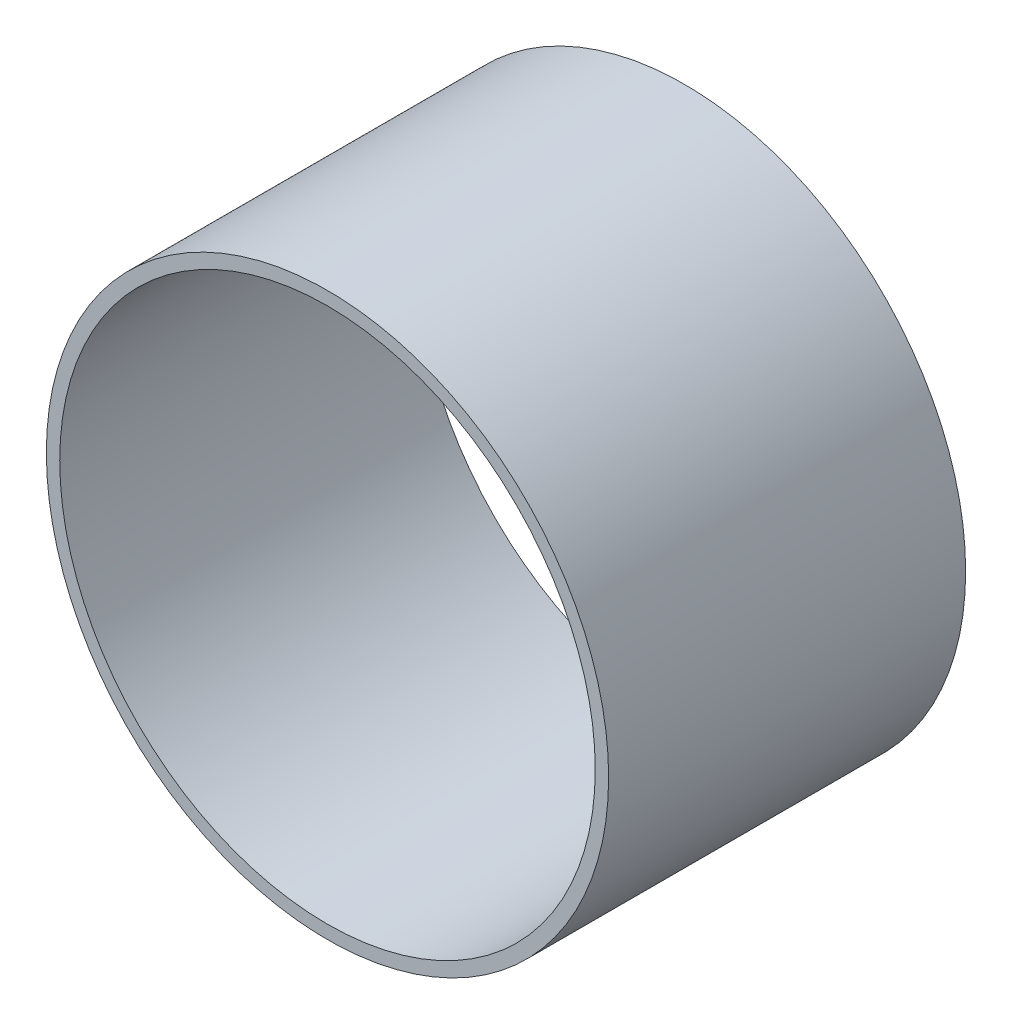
from build123d import *

# Parameters (mm, degrees)
ESQUISSE1_R      = 15.75
ESQUISSE1_R_2    = 15
EXTRUSION1_DEPTH = 20


with BuildPart() as part:
    # Esquisse1 → Extrusion1 (new body)
    with BuildSketch(Plane.XY):
        Circle(ESQUISSE1_R)
        Circle(ESQUISSE1_R_2, mode=Mode.SUBTRACT)
    extrude(amount=EXTRUSION1_DEPTH)


solid = part.part
